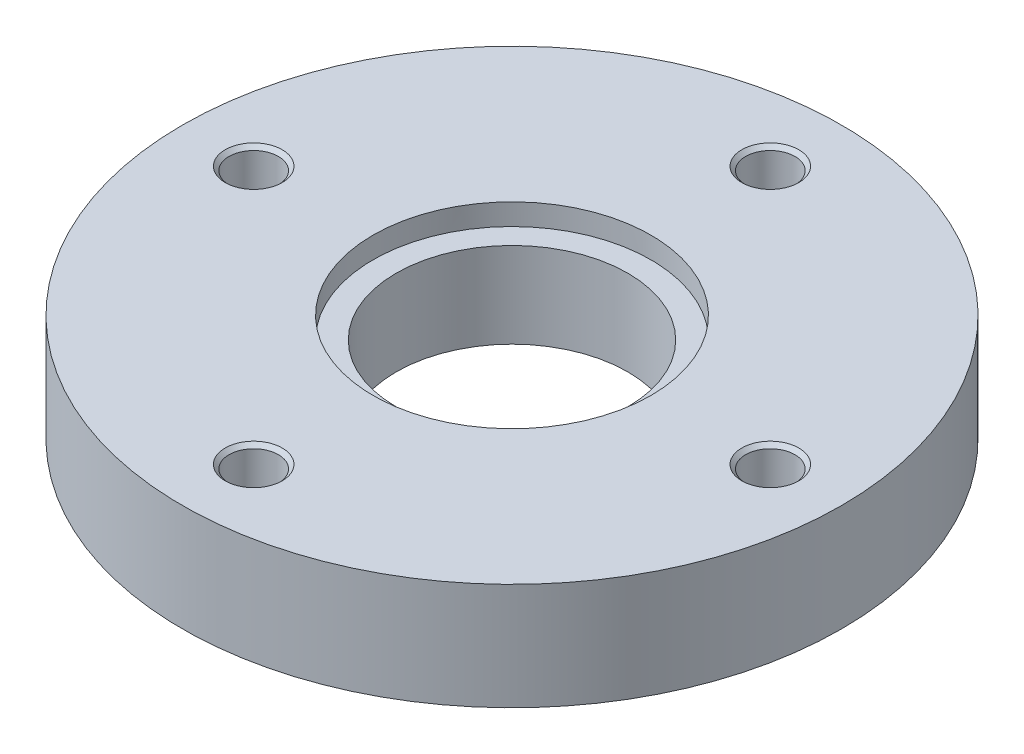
ISO-10303-21;
HEADER;
FILE_DESCRIPTION(('STEP AP214'),'2;1');
FILE_NAME('part.step','',(''),(''),'','','');
FILE_SCHEMA(('AUTOMOTIVE_DESIGN { 1 0 10303 214 1 1 1 1 }'));
ENDSEC;
DATA;
#1=APPLICATION_CONTEXT('core data for automotive mechanical design processes');
#2=APPLICATION_PROTOCOL_DEFINITION('international standard','automotive_design',2000,#1);
#3=PRODUCT_CONTEXT('',#1,'mechanical');
#4=PRODUCT('Part','Part','',(#3));
#5=PRODUCT_RELATED_PRODUCT_CATEGORY('part','',(#4));
#6=PRODUCT_DEFINITION_FORMATION('','',#4);
#7=PRODUCT_DEFINITION_CONTEXT('part definition',#1,'design');
#8=PRODUCT_DEFINITION('design','',#6,#7);
#9=PRODUCT_DEFINITION_SHAPE('','',#8);
#10=(LENGTH_UNIT() NAMED_UNIT(*) SI_UNIT(.MILLI.,.METRE.));
#11=(NAMED_UNIT(*) PLANE_ANGLE_UNIT() SI_UNIT($,.RADIAN.));
#12=(NAMED_UNIT(*) SI_UNIT($,.STERADIAN.) SOLID_ANGLE_UNIT());
#13=UNCERTAINTY_MEASURE_WITH_UNIT(LENGTH_MEASURE(1.E-05),#10,'distance_accuracy_value','');
#14=(GEOMETRIC_REPRESENTATION_CONTEXT(3) GLOBAL_UNCERTAINTY_ASSIGNED_CONTEXT((#13)) GLOBAL_UNIT_ASSIGNED_CONTEXT((#10,
#11,#12)) REPRESENTATION_CONTEXT('',''));
#15=CARTESIAN_POINT('',(0.,0.,0.));
#16=DIRECTION('',(0.,0.,1.));
#17=DIRECTION('',(1.,0.,0.));
#18=AXIS2_PLACEMENT_3D('',#15,#16,#17);
#19=CARTESIAN_POINT('',(0.,15.,0.));
#20=DIRECTION('',(0.,-1.,0.));
#21=DIRECTION('',(1.,0.,0.));
#22=AXIS2_PLACEMENT_3D('',#19,#20,#21);
#23=CYLINDRICAL_SURFACE('',#22,92.5);
#24=CARTESIAN_POINT('',(0.,0.,0.));
#25=DIRECTION('',(0.,1.,0.));
#26=DIRECTION('',(1.,0.,0.));
#27=AXIS2_PLACEMENT_3D('',#24,#25,#26);
#28=CIRCLE('',#27,92.5);
#29=CARTESIAN_POINT('',(92.5,0.,0.));
#30=VERTEX_POINT('',#29);
#31=EDGE_CURVE('E9',#30,#30,#28,.T.);
#32=ORIENTED_EDGE('',*,*,#31,.T.);
#33=EDGE_LOOP('',(#32));
#34=FACE_BOUND('',#33,.T.);
#35=CARTESIAN_POINT('',(0.,30.,0.));
#36=DIRECTION('',(0.,1.,0.));
#37=DIRECTION('',(1.,0.,0.));
#38=AXIS2_PLACEMENT_3D('',#35,#36,#37);
#39=CIRCLE('',#38,92.5);
#40=CARTESIAN_POINT('',(92.5,30.,0.));
#41=VERTEX_POINT('',#40);
#42=EDGE_CURVE('E185',#41,#41,#39,.T.);
#43=ORIENTED_EDGE('',*,*,#42,.F.);
#44=EDGE_LOOP('',(#43));
#45=FACE_BOUND('',#44,.T.);
#46=ADVANCED_FACE('F15',(#34,#45),#23,.T.);
#47=CARTESIAN_POINT('',(62.5,0.,0.));
#48=DIRECTION('',(0.,-1.,0.));
#49=DIRECTION('',(-1.,0.,0.));
#50=AXIS2_PLACEMENT_3D('',#47,#48,#49);
#51=PLANE('',#50);
#52=CARTESIAN_POINT('',(0.,0.,0.));
#53=DIRECTION('',(0.,1.,0.));
#54=DIRECTION('',(1.,0.,0.));
#55=AXIS2_PLACEMENT_3D('',#52,#53,#54);
#56=CIRCLE('',#55,32.5);
#57=CARTESIAN_POINT('',(32.5,0.,0.));
#58=VERTEX_POINT('',#57);
#59=EDGE_CURVE('E22',#58,#58,#56,.T.);
#60=ORIENTED_EDGE('',*,*,#59,.T.);
#61=EDGE_LOOP('',(#60));
#62=FACE_BOUND('',#61,.T.);
#63=ORIENTED_EDGE('',*,*,#31,.F.);
#64=EDGE_LOOP('',(#63));
#65=FACE_BOUND('',#64,.T.);
#66=ADVANCED_FACE('F191',(#62,#65),#51,.T.);
#67=CARTESIAN_POINT('',(0.,15.,0.));
#68=DIRECTION('',(0.,-1.,0.));
#69=DIRECTION('',(1.,0.,0.));
#70=AXIS2_PLACEMENT_3D('',#67,#68,#69);
#71=CYLINDRICAL_SURFACE('',#70,32.5);
#72=ORIENTED_EDGE('',*,*,#59,.F.);
#73=EDGE_LOOP('',(#72));
#74=FACE_BOUND('',#73,.T.);
#75=CARTESIAN_POINT('',(0.,24.,0.));
#76=DIRECTION('',(0.,1.,0.));
#77=DIRECTION('',(1.,0.,0.));
#78=AXIS2_PLACEMENT_3D('',#75,#76,#77);
#79=CIRCLE('',#78,32.5);
#80=CARTESIAN_POINT('',(-32.5,24.,0.));
#81=VERTEX_POINT('',#80);
#82=EDGE_CURVE('E183',#81,#81,#79,.T.);
#83=ORIENTED_EDGE('',*,*,#82,.T.);
#84=EDGE_LOOP('',(#83));
#85=FACE_BOUND('',#84,.T.);
#86=ADVANCED_FACE('F196',(#74,#85),#71,.F.);
#87=CARTESIAN_POINT('',(62.5,30.,0.));
#88=DIRECTION('',(0.,1.,0.));
#89=DIRECTION('',(1.,0.,0.));
#90=AXIS2_PLACEMENT_3D('',#87,#88,#89);
#91=PLANE('',#90);
#92=ORIENTED_EDGE('',*,*,#42,.T.);
#93=EDGE_LOOP('',(#92));
#94=FACE_BOUND('',#93,.T.);
#95=CARTESIAN_POINT('',(0.,30.,0.));
#96=DIRECTION('',(0.,-1.,0.));
#97=DIRECTION('',(1.,0.,0.));
#98=AXIS2_PLACEMENT_3D('',#95,#96,#97);
#99=CIRCLE('',#98,39.);
#100=CARTESIAN_POINT('',(-39.,30.,0.));
#101=VERTEX_POINT('',#100);
#102=EDGE_CURVE('E179',#101,#101,#99,.T.);
#103=ORIENTED_EDGE('',*,*,#102,.T.);
#104=EDGE_LOOP('',(#103));
#105=FACE_BOUND('',#104,.T.);
#106=CARTESIAN_POINT('',(72.5,30.,0.));
#107=DIRECTION('',(0.,-1.,0.));
#108=DIRECTION('',(1.,0.,0.));
#109=AXIS2_PLACEMENT_3D('',#106,#107,#108);
#110=CIRCLE('',#109,8.);
#111=CARTESIAN_POINT('',(80.5,30.,0.));
#112=VERTEX_POINT('',#111);
#113=EDGE_CURVE('E169',#112,#112,#110,.T.);
#114=ORIENTED_EDGE('',*,*,#113,.T.);
#115=EDGE_LOOP('',(#114));
#116=FACE_BOUND('',#115,.T.);
#117=CARTESIAN_POINT('',(0.,30.,-72.5));
#118=DIRECTION('',(0.,-1.,0.));
#119=DIRECTION('',(0.,0.,-1.));
#120=AXIS2_PLACEMENT_3D('',#117,#118,#119);
#121=CIRCLE('',#120,8.);
#122=CARTESIAN_POINT('',(0.,30.,-80.5));
#123=VERTEX_POINT('',#122);
#124=EDGE_CURVE('E146',#123,#123,#121,.T.);
#125=ORIENTED_EDGE('',*,*,#124,.T.);
#126=EDGE_LOOP('',(#125));
#127=FACE_BOUND('',#126,.T.);
#128=CARTESIAN_POINT('',(-72.5,30.,0.));
#129=DIRECTION('',(0.,-1.,0.));
#130=DIRECTION('',(-1.,0.,0.));
#131=AXIS2_PLACEMENT_3D('',#128,#129,#130);
#132=CIRCLE('',#131,8.);
#133=CARTESIAN_POINT('',(-80.5,30.,0.));
#134=VERTEX_POINT('',#133);
#135=EDGE_CURVE('E127',#134,#134,#132,.T.);
#136=ORIENTED_EDGE('',*,*,#135,.T.);
#137=EDGE_LOOP('',(#136));
#138=FACE_BOUND('',#137,.T.);
#139=CARTESIAN_POINT('',(0.,30.,72.5));
#140=DIRECTION('',(0.,-1.,0.));
#141=DIRECTION('',(0.,0.,1.));
#142=AXIS2_PLACEMENT_3D('',#139,#140,#141);
#143=CIRCLE('',#142,8.);
#144=CARTESIAN_POINT('',(0.,30.,80.5));
#145=VERTEX_POINT('',#144);
#146=EDGE_CURVE('E143',#145,#145,#143,.T.);
#147=ORIENTED_EDGE('',*,*,#146,.T.);
#148=EDGE_LOOP('',(#147));
#149=FACE_BOUND('',#148,.T.);
#150=ADVANCED_FACE('F128',(#94,#105,#116,#127,#138,#149),#91,.T.);
#151=CARTESIAN_POINT('',(0.,24.,0.));
#152=DIRECTION('',(0.,-1.,0.));
#153=DIRECTION('',(-1.,0.,0.));
#154=AXIS2_PLACEMENT_3D('',#151,#152,#153);
#155=PLANE('',#154);
#156=CARTESIAN_POINT('',(0.,24.,0.));
#157=DIRECTION('',(0.,-1.,0.));
#158=DIRECTION('',(1.,0.,0.));
#159=AXIS2_PLACEMENT_3D('',#156,#157,#158);
#160=CIRCLE('',#159,39.);
#161=CARTESIAN_POINT('',(39.,24.,0.));
#162=VERTEX_POINT('',#161);
#163=EDGE_CURVE('E181',#162,#162,#160,.T.);
#164=ORIENTED_EDGE('',*,*,#163,.F.);
#165=EDGE_LOOP('',(#164));
#166=FACE_BOUND('',#165,.T.);
#167=ORIENTED_EDGE('',*,*,#82,.F.);
#168=EDGE_LOOP('',(#167));
#169=FACE_BOUND('',#168,.T.);
#170=ADVANCED_FACE('F206',(#166,#169),#155,.F.);
#171=CARTESIAN_POINT('',(0.,28.5,0.));
#172=DIRECTION('',(0.,-1.,0.));
#173=DIRECTION('',(1.,0.,0.));
#174=AXIS2_PLACEMENT_3D('',#171,#172,#173);
#175=CYLINDRICAL_SURFACE('',#174,39.);
#176=ORIENTED_EDGE('',*,*,#163,.T.);
#177=EDGE_LOOP('',(#176));
#178=FACE_BOUND('',#177,.T.);
#179=ORIENTED_EDGE('',*,*,#102,.F.);
#180=EDGE_LOOP('',(#179));
#181=FACE_BOUND('',#180,.T.);
#182=ADVANCED_FACE('F209',(#178,#181),#175,.F.);
#183=CARTESIAN_POINT('',(72.5,5.00308975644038,0.));
#184=DIRECTION('',(0.,1.,0.));
#185=DIRECTION('',(1.,0.,0.));
#186=AXIS2_PLACEMENT_3D('',#183,#184,#185);
#187=CONICAL_SURFACE('',#186,3.45875,1.0471975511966);
#188=CARTESIAN_POINT('',(72.5,7.,0.));
#189=DIRECTION('',(0.,-1.,0.));
#190=DIRECTION('',(1.,0.,0.));
#191=AXIS2_PLACEMENT_3D('',#188,#189,#190);
#192=CIRCLE('',#191,6.9175);
#193=CARTESIAN_POINT('',(79.4175,7.,0.));
#194=VERTEX_POINT('',#193);
#195=EDGE_CURVE('E177',#194,#194,#192,.T.);
#196=ORIENTED_EDGE('',*,*,#195,.F.);
#197=EDGE_LOOP('',(#196));
#198=FACE_BOUND('',#197,.T.);
#199=CARTESIAN_POINT('',(72.5,3.00617951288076,0.));
#200=VERTEX_POINT('',#199);
#201=VERTEX_LOOP('',#200);
#202=FACE_BOUND('',#201,.T.);
#203=ADVANCED_FACE('F213',(#198,#202),#187,.F.);
#204=CARTESIAN_POINT('',(72.5,9.95875,0.));
#205=DIRECTION('',(0.,1.,0.));
#206=DIRECTION('',(1.,0.,0.));
#207=AXIS2_PLACEMENT_3D('',#204,#205,#206);
#208=CYLINDRICAL_SURFACE('',#207,6.9175);
#209=CARTESIAN_POINT('',(72.5,12.9175,0.));
#210=DIRECTION('',(0.,-1.,0.));
#211=DIRECTION('',(1.,0.,0.));
#212=AXIS2_PLACEMENT_3D('',#209,#210,#211);
#213=CIRCLE('',#212,6.9175);
#214=CARTESIAN_POINT('',(79.4175,12.9175,0.));
#215=VERTEX_POINT('',#214);
#216=EDGE_CURVE('E175',#215,#215,#213,.T.);
#217=ORIENTED_EDGE('',*,*,#216,.F.);
#218=EDGE_LOOP('',(#217));
#219=FACE_BOUND('',#218,.T.);
#220=ORIENTED_EDGE('',*,*,#195,.T.);
#221=EDGE_LOOP('',(#220));
#222=FACE_BOUND('',#221,.T.);
#223=ADVANCED_FACE('F217',(#219,#222),#208,.F.);
#224=CARTESIAN_POINT('',(72.5,13.45875,0.));
#225=DIRECTION('',(0.,1.,0.));
#226=DIRECTION('',(1.,0.,0.));
#227=AXIS2_PLACEMENT_3D('',#224,#225,#226);
#228=CONICAL_SURFACE('',#227,7.45875,0.785398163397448);
#229=CARTESIAN_POINT('',(72.5,14.,0.));
#230=DIRECTION('',(0.,-1.,0.));
#231=DIRECTION('',(1.,0.,0.));
#232=AXIS2_PLACEMENT_3D('',#229,#230,#231);
#233=CIRCLE('',#232,8.);
#234=CARTESIAN_POINT('',(80.5,14.,0.));
#235=VERTEX_POINT('',#234);
#236=EDGE_CURVE('E173',#235,#235,#233,.T.);
#237=ORIENTED_EDGE('',*,*,#236,.F.);
#238=EDGE_LOOP('',(#237));
#239=FACE_BOUND('',#238,.T.);
#240=ORIENTED_EDGE('',*,*,#216,.T.);
#241=EDGE_LOOP('',(#240));
#242=FACE_BOUND('',#241,.T.);
#243=ADVANCED_FACE('F221',(#239,#242),#228,.F.);
#244=CARTESIAN_POINT('',(79.95875,14.,0.));
#245=DIRECTION('',(0.,1.,0.));
#246=DIRECTION('',(-1.,0.,0.));
#247=AXIS2_PLACEMENT_3D('',#244,#245,#246);
#248=PLANE('',#247);
#249=CARTESIAN_POINT('',(72.5,14.,0.));
#250=DIRECTION('',(0.,-1.,0.));
#251=DIRECTION('',(1.,0.,0.));
#252=AXIS2_PLACEMENT_3D('',#249,#250,#251);
#253=CIRCLE('',#252,6.9175);
#254=CARTESIAN_POINT('',(79.4175,14.,0.));
#255=VERTEX_POINT('',#254);
#256=EDGE_CURVE('E171',#255,#255,#253,.T.);
#257=ORIENTED_EDGE('',*,*,#256,.F.);
#258=EDGE_LOOP('',(#257));
#259=FACE_BOUND('',#258,.T.);
#260=ORIENTED_EDGE('',*,*,#236,.T.);
#261=EDGE_LOOP('',(#260));
#262=FACE_BOUND('',#261,.T.);
#263=ADVANCED_FACE('F225',(#259,#262),#248,.F.);
#264=CARTESIAN_POINT('',(72.5,21.45875,0.));
#265=DIRECTION('',(0.,1.,0.));
#266=DIRECTION('',(1.,0.,0.));
#267=AXIS2_PLACEMENT_3D('',#264,#265,#266);
#268=CYLINDRICAL_SURFACE('',#267,6.9175);
#269=CARTESIAN_POINT('',(72.5,28.9175,0.));
#270=DIRECTION('',(0.,-1.,0.));
#271=DIRECTION('',(1.,0.,0.));
#272=AXIS2_PLACEMENT_3D('',#269,#270,#271);
#273=CIRCLE('',#272,6.9175);
#274=CARTESIAN_POINT('',(79.4175,28.9175,0.));
#275=VERTEX_POINT('',#274);
#276=EDGE_CURVE('E167',#275,#275,#273,.T.);
#277=ORIENTED_EDGE('',*,*,#276,.F.);
#278=EDGE_LOOP('',(#277));
#279=FACE_BOUND('',#278,.T.);
#280=ORIENTED_EDGE('',*,*,#256,.T.);
#281=EDGE_LOOP('',(#280));
#282=FACE_BOUND('',#281,.T.);
#283=ADVANCED_FACE('F229',(#279,#282),#268,.F.);
#284=CARTESIAN_POINT('',(72.5,29.45875,0.));
#285=DIRECTION('',(0.,1.,0.));
#286=DIRECTION('',(1.,0.,0.));
#287=AXIS2_PLACEMENT_3D('',#284,#285,#286);
#288=CONICAL_SURFACE('',#287,7.45875,0.785398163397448);
#289=ORIENTED_EDGE('',*,*,#113,.F.);
#290=EDGE_LOOP('',(#289));
#291=FACE_BOUND('',#290,.T.);
#292=ORIENTED_EDGE('',*,*,#276,.T.);
#293=EDGE_LOOP('',(#292));
#294=FACE_BOUND('',#293,.T.);
#295=ADVANCED_FACE('F233',(#291,#294),#288,.F.);
#296=CARTESIAN_POINT('',(0.,5.00308975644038,-72.5));
#297=DIRECTION('',(0.,1.,0.));
#298=DIRECTION('',(0.,0.,-1.));
#299=AXIS2_PLACEMENT_3D('',#296,#297,#298);
#300=CONICAL_SURFACE('',#299,3.45875,1.0471975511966);
#301=CARTESIAN_POINT('',(0.,7.,-72.5));
#302=DIRECTION('',(0.,-1.,0.));
#303=DIRECTION('',(0.,0.,-1.));
#304=AXIS2_PLACEMENT_3D('',#301,#302,#303);
#305=CIRCLE('',#304,6.9175);
#306=CARTESIAN_POINT('',(0.,7.,-79.4175));
#307=VERTEX_POINT('',#306);
#308=EDGE_CURVE('E165',#307,#307,#305,.T.);
#309=ORIENTED_EDGE('',*,*,#308,.F.);
#310=EDGE_LOOP('',(#309));
#311=FACE_BOUND('',#310,.T.);
#312=CARTESIAN_POINT('',(0.,3.00617951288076,-72.5));
#313=VERTEX_POINT('',#312);
#314=VERTEX_LOOP('',#313);
#315=FACE_BOUND('',#314,.T.);
#316=ADVANCED_FACE('F237',(#311,#315),#300,.F.);
#317=CARTESIAN_POINT('',(0.,9.95875,-72.5));
#318=DIRECTION('',(0.,1.,0.));
#319=DIRECTION('',(0.,0.,-1.));
#320=AXIS2_PLACEMENT_3D('',#317,#318,#319);
#321=CYLINDRICAL_SURFACE('',#320,6.9175);
#322=CARTESIAN_POINT('',(0.,12.9175,-72.5));
#323=DIRECTION('',(0.,-1.,0.));
#324=DIRECTION('',(0.,0.,-1.));
#325=AXIS2_PLACEMENT_3D('',#322,#323,#324);
#326=CIRCLE('',#325,6.9175);
#327=CARTESIAN_POINT('',(0.,12.9175,-79.4175));
#328=VERTEX_POINT('',#327);
#329=EDGE_CURVE('E163',#328,#328,#326,.T.);
#330=ORIENTED_EDGE('',*,*,#329,.F.);
#331=EDGE_LOOP('',(#330));
#332=FACE_BOUND('',#331,.T.);
#333=ORIENTED_EDGE('',*,*,#308,.T.);
#334=EDGE_LOOP('',(#333));
#335=FACE_BOUND('',#334,.T.);
#336=ADVANCED_FACE('F241',(#332,#335),#321,.F.);
#337=CARTESIAN_POINT('',(0.,13.45875,-72.5));
#338=DIRECTION('',(0.,1.,0.));
#339=DIRECTION('',(0.,0.,-1.));
#340=AXIS2_PLACEMENT_3D('',#337,#338,#339);
#341=CONICAL_SURFACE('',#340,7.45875,0.785398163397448);
#342=CARTESIAN_POINT('',(0.,14.,-72.5));
#343=DIRECTION('',(0.,-1.,0.));
#344=DIRECTION('',(0.,0.,-1.));
#345=AXIS2_PLACEMENT_3D('',#342,#343,#344);
#346=CIRCLE('',#345,8.);
#347=CARTESIAN_POINT('',(0.,14.,-80.5));
#348=VERTEX_POINT('',#347);
#349=EDGE_CURVE('E161',#348,#348,#346,.T.);
#350=ORIENTED_EDGE('',*,*,#349,.F.);
#351=EDGE_LOOP('',(#350));
#352=FACE_BOUND('',#351,.T.);
#353=ORIENTED_EDGE('',*,*,#329,.T.);
#354=EDGE_LOOP('',(#353));
#355=FACE_BOUND('',#354,.T.);
#356=ADVANCED_FACE('F245',(#352,#355),#341,.F.);
#357=CARTESIAN_POINT('',(0.,14.,-79.95875));
#358=DIRECTION('',(0.,1.,0.));
#359=DIRECTION('',(0.,0.,1.));
#360=AXIS2_PLACEMENT_3D('',#357,#358,#359);
#361=PLANE('',#360);
#362=CARTESIAN_POINT('',(0.,14.,-72.5));
#363=DIRECTION('',(0.,-1.,0.));
#364=DIRECTION('',(0.,0.,-1.));
#365=AXIS2_PLACEMENT_3D('',#362,#363,#364);
#366=CIRCLE('',#365,6.9175);
#367=CARTESIAN_POINT('',(0.,14.,-79.4175));
#368=VERTEX_POINT('',#367);
#369=EDGE_CURVE('E148',#368,#368,#366,.T.);
#370=ORIENTED_EDGE('',*,*,#369,.F.);
#371=EDGE_LOOP('',(#370));
#372=FACE_BOUND('',#371,.T.);
#373=ORIENTED_EDGE('',*,*,#349,.T.);
#374=EDGE_LOOP('',(#373));
#375=FACE_BOUND('',#374,.T.);
#376=ADVANCED_FACE('F249',(#372,#375),#361,.F.);
#377=CARTESIAN_POINT('',(0.,21.45875,-72.5));
#378=DIRECTION('',(0.,1.,0.));
#379=DIRECTION('',(0.,0.,-1.));
#380=AXIS2_PLACEMENT_3D('',#377,#378,#379);
#381=CYLINDRICAL_SURFACE('',#380,6.9175);
#382=CARTESIAN_POINT('',(0.,28.9175,-72.5));
#383=DIRECTION('',(0.,-1.,0.));
#384=DIRECTION('',(0.,0.,-1.));
#385=AXIS2_PLACEMENT_3D('',#382,#383,#384);
#386=CIRCLE('',#385,6.9175);
#387=CARTESIAN_POINT('',(0.,28.9175,-79.4175));
#388=VERTEX_POINT('',#387);
#389=EDGE_CURVE('E149',#388,#388,#386,.T.);
#390=ORIENTED_EDGE('',*,*,#389,.F.);
#391=EDGE_LOOP('',(#390));
#392=FACE_BOUND('',#391,.T.);
#393=ORIENTED_EDGE('',*,*,#369,.T.);
#394=EDGE_LOOP('',(#393));
#395=FACE_BOUND('',#394,.T.);
#396=ADVANCED_FACE('F253',(#392,#395),#381,.F.);
#397=CARTESIAN_POINT('',(0.,29.45875,-72.5));
#398=DIRECTION('',(0.,1.,0.));
#399=DIRECTION('',(0.,0.,-1.));
#400=AXIS2_PLACEMENT_3D('',#397,#398,#399);
#401=CONICAL_SURFACE('',#400,7.45875,0.785398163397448);
#402=ORIENTED_EDGE('',*,*,#124,.F.);
#403=EDGE_LOOP('',(#402));
#404=FACE_BOUND('',#403,.T.);
#405=ORIENTED_EDGE('',*,*,#389,.T.);
#406=EDGE_LOOP('',(#405));
#407=FACE_BOUND('',#406,.T.);
#408=ADVANCED_FACE('F257',(#404,#407),#401,.F.);
#409=CARTESIAN_POINT('',(-72.5,5.00308975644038,0.));
#410=DIRECTION('',(0.,1.,0.));
#411=DIRECTION('',(-1.,0.,0.));
#412=AXIS2_PLACEMENT_3D('',#409,#410,#411);
#413=CONICAL_SURFACE('',#412,3.45875,1.0471975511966);
#414=CARTESIAN_POINT('',(-72.5,7.,0.));
#415=DIRECTION('',(0.,-1.,0.));
#416=DIRECTION('',(-1.,0.,0.));
#417=AXIS2_PLACEMENT_3D('',#414,#415,#416);
#418=CIRCLE('',#417,6.9175);
#419=CARTESIAN_POINT('',(-79.4175,7.,0.));
#420=VERTEX_POINT('',#419);
#421=EDGE_CURVE('E150',#420,#420,#418,.T.);
#422=ORIENTED_EDGE('',*,*,#421,.F.);
#423=EDGE_LOOP('',(#422));
#424=FACE_BOUND('',#423,.T.);
#425=CARTESIAN_POINT('',(-72.5,3.00617951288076,0.));
#426=VERTEX_POINT('',#425);
#427=VERTEX_LOOP('',#426);
#428=FACE_BOUND('',#427,.T.);
#429=ADVANCED_FACE('F275',(#424,#428),#413,.F.);
#430=CARTESIAN_POINT('',(-72.5,9.95875,0.));
#431=DIRECTION('',(0.,1.,0.));
#432=DIRECTION('',(-1.,0.,0.));
#433=AXIS2_PLACEMENT_3D('',#430,#431,#432);
#434=CYLINDRICAL_SURFACE('',#433,6.9175);
#435=CARTESIAN_POINT('',(-72.5,12.9175,0.));
#436=DIRECTION('',(0.,-1.,0.));
#437=DIRECTION('',(-1.,0.,0.));
#438=AXIS2_PLACEMENT_3D('',#435,#436,#437);
#439=CIRCLE('',#438,6.9175);
#440=CARTESIAN_POINT('',(-79.4175,12.9175,0.));
#441=VERTEX_POINT('',#440);
#442=EDGE_CURVE('E151',#441,#441,#439,.T.);
#443=ORIENTED_EDGE('',*,*,#442,.F.);
#444=EDGE_LOOP('',(#443));
#445=FACE_BOUND('',#444,.T.);
#446=ORIENTED_EDGE('',*,*,#421,.T.);
#447=EDGE_LOOP('',(#446));
#448=FACE_BOUND('',#447,.T.);
#449=ADVANCED_FACE('F263',(#445,#448),#434,.F.);
#450=CARTESIAN_POINT('',(-72.5,13.45875,0.));
#451=DIRECTION('',(0.,1.,0.));
#452=DIRECTION('',(-1.,0.,0.));
#453=AXIS2_PLACEMENT_3D('',#450,#451,#452);
#454=CONICAL_SURFACE('',#453,7.45875,0.785398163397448);
#455=CARTESIAN_POINT('',(-72.5,14.,0.));
#456=DIRECTION('',(0.,-1.,0.));
#457=DIRECTION('',(-1.,0.,0.));
#458=AXIS2_PLACEMENT_3D('',#455,#456,#457);
#459=CIRCLE('',#458,8.);
#460=CARTESIAN_POINT('',(-80.5,14.,0.));
#461=VERTEX_POINT('',#460);
#462=EDGE_CURVE('E134',#461,#461,#459,.T.);
#463=ORIENTED_EDGE('',*,*,#462,.F.);
#464=EDGE_LOOP('',(#463));
#465=FACE_BOUND('',#464,.T.);
#466=ORIENTED_EDGE('',*,*,#442,.T.);
#467=EDGE_LOOP('',(#466));
#468=FACE_BOUND('',#467,.T.);
#469=ADVANCED_FACE('F259',(#465,#468),#454,.F.);
#470=CARTESIAN_POINT('',(-79.95875,14.,0.));
#471=DIRECTION('',(0.,1.,0.));
#472=DIRECTION('',(1.,0.,0.));
#473=AXIS2_PLACEMENT_3D('',#470,#471,#472);
#474=PLANE('',#473);
#475=CARTESIAN_POINT('',(-72.5,14.,0.));
#476=DIRECTION('',(0.,-1.,0.));
#477=DIRECTION('',(-1.,0.,0.));
#478=AXIS2_PLACEMENT_3D('',#475,#476,#477);
#479=CIRCLE('',#478,6.9175);
#480=CARTESIAN_POINT('',(-79.4175,14.,0.));
#481=VERTEX_POINT('',#480);
#482=EDGE_CURVE('E131',#481,#481,#479,.T.);
#483=ORIENTED_EDGE('',*,*,#482,.F.);
#484=EDGE_LOOP('',(#483));
#485=FACE_BOUND('',#484,.T.);
#486=ORIENTED_EDGE('',*,*,#462,.T.);
#487=EDGE_LOOP('',(#486));
#488=FACE_BOUND('',#487,.T.);
#489=ADVANCED_FACE('F262',(#485,#488),#474,.F.);
#490=CARTESIAN_POINT('',(-72.5,21.45875,0.));
#491=DIRECTION('',(0.,1.,0.));
#492=DIRECTION('',(-1.,0.,0.));
#493=AXIS2_PLACEMENT_3D('',#490,#491,#492);
#494=CYLINDRICAL_SURFACE('',#493,6.9175);
#495=CARTESIAN_POINT('',(-72.5,28.9175,0.));
#496=DIRECTION('',(0.,-1.,0.));
#497=DIRECTION('',(-1.,0.,0.));
#498=AXIS2_PLACEMENT_3D('',#495,#496,#497);
#499=CIRCLE('',#498,6.9175);
#500=CARTESIAN_POINT('',(-79.4175,28.9175,0.));
#501=VERTEX_POINT('',#500);
#502=EDGE_CURVE('E132',#501,#501,#499,.T.);
#503=ORIENTED_EDGE('',*,*,#502,.F.);
#504=EDGE_LOOP('',(#503));
#505=FACE_BOUND('',#504,.T.);
#506=ORIENTED_EDGE('',*,*,#482,.T.);
#507=EDGE_LOOP('',(#506));
#508=FACE_BOUND('',#507,.T.);
#509=ADVANCED_FACE('F267',(#505,#508),#494,.F.);
#510=CARTESIAN_POINT('',(-72.5,29.45875,0.));
#511=DIRECTION('',(0.,1.,0.));
#512=DIRECTION('',(-1.,0.,0.));
#513=AXIS2_PLACEMENT_3D('',#510,#511,#512);
#514=CONICAL_SURFACE('',#513,7.45875,0.785398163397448);
#515=ORIENTED_EDGE('',*,*,#135,.F.);
#516=EDGE_LOOP('',(#515));
#517=FACE_BOUND('',#516,.T.);
#518=ORIENTED_EDGE('',*,*,#502,.T.);
#519=EDGE_LOOP('',(#518));
#520=FACE_BOUND('',#519,.T.);
#521=ADVANCED_FACE('F271',(#517,#520),#514,.F.);
#522=CARTESIAN_POINT('',(0.,5.00308975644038,72.5));
#523=DIRECTION('',(0.,1.,0.));
#524=DIRECTION('',(0.,0.,1.));
#525=AXIS2_PLACEMENT_3D('',#522,#523,#524);
#526=CONICAL_SURFACE('',#525,3.45875,1.0471975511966);
#527=CARTESIAN_POINT('',(0.,7.,72.5));
#528=DIRECTION('',(0.,-1.,0.));
#529=DIRECTION('',(0.,0.,1.));
#530=AXIS2_PLACEMENT_3D('',#527,#528,#529);
#531=CIRCLE('',#530,6.9175);
#532=CARTESIAN_POINT('',(0.,7.,79.4175));
#533=VERTEX_POINT('',#532);
#534=EDGE_CURVE('E136',#533,#533,#531,.T.);
#535=ORIENTED_EDGE('',*,*,#534,.F.);
#536=EDGE_LOOP('',(#535));
#537=FACE_BOUND('',#536,.T.);
#538=CARTESIAN_POINT('',(0.,3.00617951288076,72.5));
#539=VERTEX_POINT('',#538);
#540=VERTEX_LOOP('',#539);
#541=FACE_BOUND('',#540,.T.);
#542=ADVANCED_FACE('F277',(#537,#541),#526,.F.);
#543=CARTESIAN_POINT('',(0.,9.95875,72.5));
#544=DIRECTION('',(0.,1.,0.));
#545=DIRECTION('',(0.,0.,1.));
#546=AXIS2_PLACEMENT_3D('',#543,#544,#545);
#547=CYLINDRICAL_SURFACE('',#546,6.9175);
#548=CARTESIAN_POINT('',(0.,12.9175,72.5));
#549=DIRECTION('',(0.,-1.,0.));
#550=DIRECTION('',(0.,0.,1.));
#551=AXIS2_PLACEMENT_3D('',#548,#549,#550);
#552=CIRCLE('',#551,6.9175);
#553=CARTESIAN_POINT('',(0.,12.9175,79.4175));
#554=VERTEX_POINT('',#553);
#555=EDGE_CURVE('E140',#554,#554,#552,.T.);
#556=ORIENTED_EDGE('',*,*,#555,.F.);
#557=EDGE_LOOP('',(#556));
#558=FACE_BOUND('',#557,.T.);
#559=ORIENTED_EDGE('',*,*,#534,.T.);
#560=EDGE_LOOP('',(#559));
#561=FACE_BOUND('',#560,.T.);
#562=ADVANCED_FACE('F280',(#558,#561),#547,.F.);
#563=CARTESIAN_POINT('',(0.,13.45875,72.5));
#564=DIRECTION('',(0.,1.,0.));
#565=DIRECTION('',(0.,0.,1.));
#566=AXIS2_PLACEMENT_3D('',#563,#564,#565);
#567=CONICAL_SURFACE('',#566,7.45875,0.785398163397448);
#568=CARTESIAN_POINT('',(0.,14.,72.5));
#569=DIRECTION('',(0.,-1.,0.));
#570=DIRECTION('',(0.,0.,1.));
#571=AXIS2_PLACEMENT_3D('',#568,#569,#570);
#572=CIRCLE('',#571,8.);
#573=CARTESIAN_POINT('',(0.,14.,80.5));
#574=VERTEX_POINT('',#573);
#575=EDGE_CURVE('E154',#574,#574,#572,.T.);
#576=ORIENTED_EDGE('',*,*,#575,.F.);
#577=EDGE_LOOP('',(#576));
#578=FACE_BOUND('',#577,.T.);
#579=ORIENTED_EDGE('',*,*,#555,.T.);
#580=EDGE_LOOP('',(#579));
#581=FACE_BOUND('',#580,.T.);
#582=ADVANCED_FACE('F282',(#578,#581),#567,.F.);
#583=CARTESIAN_POINT('',(0.,14.,79.95875));
#584=DIRECTION('',(0.,1.,0.));
#585=DIRECTION('',(0.,0.,-1.));
#586=AXIS2_PLACEMENT_3D('',#583,#584,#585);
#587=PLANE('',#586);
#588=CARTESIAN_POINT('',(0.,14.,72.5));
#589=DIRECTION('',(0.,-1.,0.));
#590=DIRECTION('',(0.,0.,1.));
#591=AXIS2_PLACEMENT_3D('',#588,#589,#590);
#592=CIRCLE('',#591,6.9175);
#593=CARTESIAN_POINT('',(0.,14.,79.4175));
#594=VERTEX_POINT('',#593);
#595=EDGE_CURVE('E145',#594,#594,#592,.T.);
#596=ORIENTED_EDGE('',*,*,#595,.F.);
#597=EDGE_LOOP('',(#596));
#598=FACE_BOUND('',#597,.T.);
#599=ORIENTED_EDGE('',*,*,#575,.T.);
#600=EDGE_LOOP('',(#599));
#601=FACE_BOUND('',#600,.T.);
#602=ADVANCED_FACE('F285',(#598,#601),#587,.F.);
#603=CARTESIAN_POINT('',(0.,21.45875,72.5));
#604=DIRECTION('',(0.,1.,0.));
#605=DIRECTION('',(0.,0.,1.));
#606=AXIS2_PLACEMENT_3D('',#603,#604,#605);
#607=CYLINDRICAL_SURFACE('',#606,6.9175);
#608=CARTESIAN_POINT('',(0.,28.9175,72.5));
#609=DIRECTION('',(0.,-1.,0.));
#610=DIRECTION('',(0.,0.,1.));
#611=AXIS2_PLACEMENT_3D('',#608,#609,#610);
#612=CIRCLE('',#611,6.9175);
#613=CARTESIAN_POINT('',(0.,28.9175,79.4175));
#614=VERTEX_POINT('',#613);
#615=EDGE_CURVE('E141',#614,#614,#612,.T.);
#616=ORIENTED_EDGE('',*,*,#615,.F.);
#617=EDGE_LOOP('',(#616));
#618=FACE_BOUND('',#617,.T.);
#619=ORIENTED_EDGE('',*,*,#595,.T.);
#620=EDGE_LOOP('',(#619));
#621=FACE_BOUND('',#620,.T.);
#622=ADVANCED_FACE('F289',(#618,#621),#607,.F.);
#623=CARTESIAN_POINT('',(0.,29.45875,72.5));
#624=DIRECTION('',(0.,1.,0.));
#625=DIRECTION('',(0.,0.,1.));
#626=AXIS2_PLACEMENT_3D('',#623,#624,#625);
#627=CONICAL_SURFACE('',#626,7.45875,0.785398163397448);
#628=ORIENTED_EDGE('',*,*,#146,.F.);
#629=EDGE_LOOP('',(#628));
#630=FACE_BOUND('',#629,.T.);
#631=ORIENTED_EDGE('',*,*,#615,.T.);
#632=EDGE_LOOP('',(#631));
#633=FACE_BOUND('',#632,.T.);
#634=ADVANCED_FACE('F296',(#630,#633),#627,.F.);
#635=CLOSED_SHELL('',(#46,#66,#86,#150,#170,#182,#203,#223,#243,#263,#283,#295,#316,#336,#356,
#376,#396,#408,#429,#449,#469,#489,#509,#521,#542,#562,#582,#602,#622,#634));
#636=MANIFOLD_SOLID_BREP('B1',#635);
#637=ADVANCED_BREP_SHAPE_REPRESENTATION('',(#18,#636),#14);
#638=SHAPE_DEFINITION_REPRESENTATION(#9,#637);
ENDSEC;
END-ISO-10303-21;
